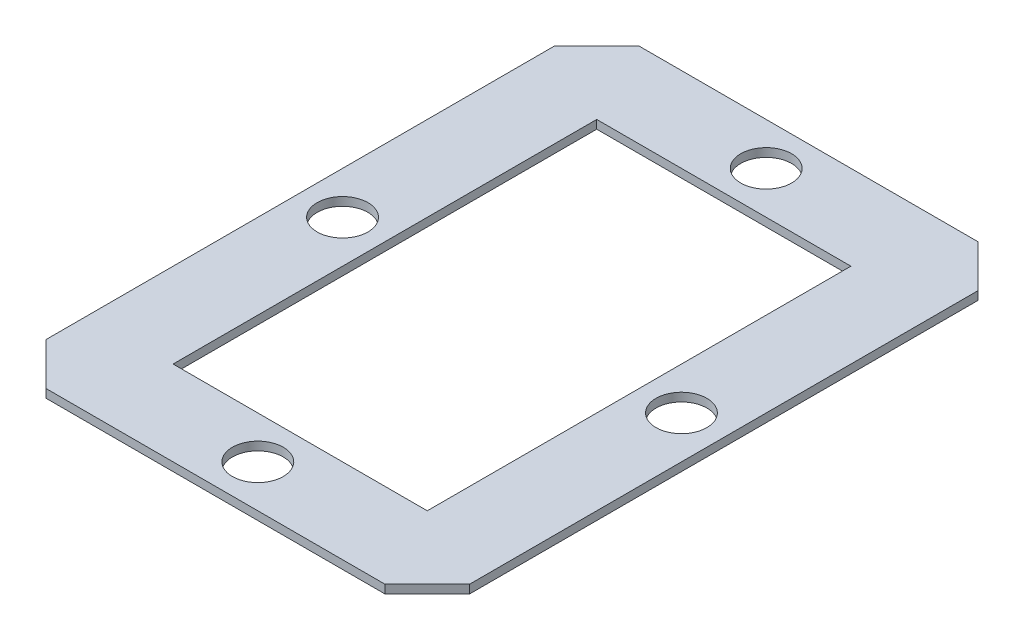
ISO-10303-21;
HEADER;
FILE_DESCRIPTION(('STEP AP214'),'2;1');
FILE_NAME('part.step','',(''),(''),'','','');
FILE_SCHEMA(('AUTOMOTIVE_DESIGN { 1 0 10303 214 1 1 1 1 }'));
ENDSEC;
DATA;
#1=APPLICATION_CONTEXT('core data for automotive mechanical design processes');
#2=APPLICATION_PROTOCOL_DEFINITION('international standard','automotive_design',2000,#1);
#3=PRODUCT_CONTEXT('',#1,'mechanical');
#4=PRODUCT('Part','Part','',(#3));
#5=PRODUCT_RELATED_PRODUCT_CATEGORY('part','',(#4));
#6=PRODUCT_DEFINITION_FORMATION('','',#4);
#7=PRODUCT_DEFINITION_CONTEXT('part definition',#1,'design');
#8=PRODUCT_DEFINITION('design','',#6,#7);
#9=PRODUCT_DEFINITION_SHAPE('','',#8);
#10=(LENGTH_UNIT() NAMED_UNIT(*) SI_UNIT(.MILLI.,.METRE.));
#11=(NAMED_UNIT(*) PLANE_ANGLE_UNIT() SI_UNIT($,.RADIAN.));
#12=(NAMED_UNIT(*) SI_UNIT($,.STERADIAN.) SOLID_ANGLE_UNIT());
#13=UNCERTAINTY_MEASURE_WITH_UNIT(LENGTH_MEASURE(1.E-05),#10,'distance_accuracy_value','');
#14=(GEOMETRIC_REPRESENTATION_CONTEXT(3) GLOBAL_UNCERTAINTY_ASSIGNED_CONTEXT((#13)) GLOBAL_UNIT_ASSIGNED_CONTEXT((#10,
#11,#12)) REPRESENTATION_CONTEXT('',''));
#15=CARTESIAN_POINT('',(0.,0.,0.));
#16=DIRECTION('',(0.,0.,1.));
#17=DIRECTION('',(1.,0.,0.));
#18=AXIS2_PLACEMENT_3D('',#15,#16,#17);
#19=CARTESIAN_POINT('',(-50.,2.,-70.));
#20=DIRECTION('',(0.,0.,1.));
#21=DIRECTION('',(1.,0.,0.));
#22=AXIS2_PLACEMENT_3D('',#19,#20,#21);
#23=PLANE('',#22);
#24=DIRECTION('',(-1.,0.,0.));
#25=VECTOR('',#24,1.);
#26=CARTESIAN_POINT('',(-50.,0.,-70.));
#27=LINE('',#26,#25);
#28=CARTESIAN_POINT('',(40.,0.,-70.));
#29=VERTEX_POINT('',#28);
#30=CARTESIAN_POINT('',(-40.,0.,-70.));
#31=VERTEX_POINT('',#30);
#32=EDGE_CURVE('E177',#29,#31,#27,.T.);
#33=ORIENTED_EDGE('',*,*,#32,.T.);
#34=DIRECTION('',(0.,1.,0.));
#35=VECTOR('',#34,1.);
#36=CARTESIAN_POINT('',(-40.,2.,-70.));
#37=LINE('',#36,#35);
#38=CARTESIAN_POINT('',(-40.,2.,-70.));
#39=VERTEX_POINT('',#38);
#40=EDGE_CURVE('E219',#31,#39,#37,.T.);
#41=ORIENTED_EDGE('',*,*,#40,.T.);
#42=DIRECTION('',(-1.,0.,0.));
#43=VECTOR('',#42,1.);
#44=CARTESIAN_POINT('',(-50.,2.,-70.));
#45=LINE('',#44,#43);
#46=CARTESIAN_POINT('',(40.,2.,-70.));
#47=VERTEX_POINT('',#46);
#48=EDGE_CURVE('E180',#47,#39,#45,.T.);
#49=ORIENTED_EDGE('',*,*,#48,.F.);
#50=DIRECTION('',(0.,-1.,0.));
#51=VECTOR('',#50,1.);
#52=CARTESIAN_POINT('',(40.,2.,-70.));
#53=LINE('',#52,#51);
#54=EDGE_CURVE('E216',#47,#29,#53,.T.);
#55=ORIENTED_EDGE('',*,*,#54,.T.);
#56=EDGE_LOOP('',(#33,#41,#49,#55));
#57=FACE_BOUND('',#56,.T.);
#58=ADVANCED_FACE('F33',(#57),#23,.F.);
#59=CARTESIAN_POINT('',(-50.,2.,70.));
#60=DIRECTION('',(1.,0.,0.));
#61=DIRECTION('',(0.,0.,-1.));
#62=AXIS2_PLACEMENT_3D('',#59,#60,#61);
#63=PLANE('',#62);
#64=DIRECTION('',(0.,0.,1.));
#65=VECTOR('',#64,1.);
#66=CARTESIAN_POINT('',(-50.,2.,70.));
#67=LINE('',#66,#65);
#68=CARTESIAN_POINT('',(-50.,2.,-60.));
#69=VERTEX_POINT('',#68);
#70=CARTESIAN_POINT('',(-50.,2.,60.));
#71=VERTEX_POINT('',#70);
#72=EDGE_CURVE('E183',#69,#71,#67,.T.);
#73=ORIENTED_EDGE('',*,*,#72,.F.);
#74=DIRECTION('',(0.,-1.,0.));
#75=VECTOR('',#74,1.);
#76=CARTESIAN_POINT('',(-50.,2.,-60.));
#77=LINE('',#76,#75);
#78=CARTESIAN_POINT('',(-50.,0.,-60.));
#79=VERTEX_POINT('',#78);
#80=EDGE_CURVE('E205',#69,#79,#77,.T.);
#81=ORIENTED_EDGE('',*,*,#80,.T.);
#82=DIRECTION('',(0.,0.,1.));
#83=VECTOR('',#82,1.);
#84=CARTESIAN_POINT('',(-50.,0.,70.));
#85=LINE('',#84,#83);
#86=CARTESIAN_POINT('',(-50.,0.,60.));
#87=VERTEX_POINT('',#86);
#88=EDGE_CURVE('E196',#79,#87,#85,.T.);
#89=ORIENTED_EDGE('',*,*,#88,.T.);
#90=DIRECTION('',(0.,1.,0.));
#91=VECTOR('',#90,1.);
#92=CARTESIAN_POINT('',(-50.,2.,60.));
#93=LINE('',#92,#91);
#94=EDGE_CURVE('E193',#87,#71,#93,.T.);
#95=ORIENTED_EDGE('',*,*,#94,.T.);
#96=EDGE_LOOP('',(#73,#81,#89,#95));
#97=FACE_BOUND('',#96,.T.);
#98=ADVANCED_FACE('F269',(#97),#63,.F.);
#99=CARTESIAN_POINT('',(-50.,2.,70.));
#100=DIRECTION('',(0.,0.,-1.));
#101=DIRECTION('',(-1.,0.,0.));
#102=AXIS2_PLACEMENT_3D('',#99,#100,#101);
#103=PLANE('',#102);
#104=DIRECTION('',(1.,0.,0.));
#105=VECTOR('',#104,1.);
#106=CARTESIAN_POINT('',(-50.,0.,70.));
#107=LINE('',#106,#105);
#108=CARTESIAN_POINT('',(-40.,0.,70.));
#109=VERTEX_POINT('',#108);
#110=CARTESIAN_POINT('',(40.,0.,70.));
#111=VERTEX_POINT('',#110);
#112=EDGE_CURVE('E199',#109,#111,#107,.T.);
#113=ORIENTED_EDGE('',*,*,#112,.T.);
#114=DIRECTION('',(0.,1.,0.));
#115=VECTOR('',#114,1.);
#116=CARTESIAN_POINT('',(40.,2.,70.));
#117=LINE('',#116,#115);
#118=CARTESIAN_POINT('',(40.,2.,70.));
#119=VERTEX_POINT('',#118);
#120=EDGE_CURVE('E11',#111,#119,#117,.T.);
#121=ORIENTED_EDGE('',*,*,#120,.T.);
#122=DIRECTION('',(1.,0.,0.));
#123=VECTOR('',#122,1.);
#124=CARTESIAN_POINT('',(-50.,2.,70.));
#125=LINE('',#124,#123);
#126=CARTESIAN_POINT('',(-40.,2.,70.));
#127=VERTEX_POINT('',#126);
#128=EDGE_CURVE('E187',#127,#119,#125,.T.);
#129=ORIENTED_EDGE('',*,*,#128,.F.);
#130=DIRECTION('',(0.,-1.,0.));
#131=VECTOR('',#130,1.);
#132=CARTESIAN_POINT('',(-40.,2.,70.));
#133=LINE('',#132,#131);
#134=EDGE_CURVE('E41',#127,#109,#133,.T.);
#135=ORIENTED_EDGE('',*,*,#134,.T.);
#136=EDGE_LOOP('',(#113,#121,#129,#135));
#137=FACE_BOUND('',#136,.T.);
#138=ADVANCED_FACE('F238',(#137),#103,.F.);
#139=CARTESIAN_POINT('',(50.,2.,70.));
#140=DIRECTION('',(-1.,0.,0.));
#141=DIRECTION('',(0.,0.,1.));
#142=AXIS2_PLACEMENT_3D('',#139,#140,#141);
#143=PLANE('',#142);
#144=DIRECTION('',(0.,0.,-1.));
#145=VECTOR('',#144,1.);
#146=CARTESIAN_POINT('',(50.,0.,70.));
#147=LINE('',#146,#145);
#148=CARTESIAN_POINT('',(50.,0.,60.));
#149=VERTEX_POINT('',#148);
#150=CARTESIAN_POINT('',(50.,0.,-60.));
#151=VERTEX_POINT('',#150);
#152=EDGE_CURVE('E184',#149,#151,#147,.T.);
#153=ORIENTED_EDGE('',*,*,#152,.T.);
#154=DIRECTION('',(0.,1.,0.));
#155=VECTOR('',#154,1.);
#156=CARTESIAN_POINT('',(50.,2.,-60.));
#157=LINE('',#156,#155);
#158=CARTESIAN_POINT('',(50.,2.,-60.));
#159=VERTEX_POINT('',#158);
#160=EDGE_CURVE('E232',#151,#159,#157,.T.);
#161=ORIENTED_EDGE('',*,*,#160,.T.);
#162=DIRECTION('',(0.,0.,-1.));
#163=VECTOR('',#162,1.);
#164=CARTESIAN_POINT('',(50.,2.,70.));
#165=LINE('',#164,#163);
#166=CARTESIAN_POINT('',(50.,2.,60.));
#167=VERTEX_POINT('',#166);
#168=EDGE_CURVE('E190',#167,#159,#165,.T.);
#169=ORIENTED_EDGE('',*,*,#168,.F.);
#170=DIRECTION('',(0.,-1.,0.));
#171=VECTOR('',#170,1.);
#172=CARTESIAN_POINT('',(50.,2.,60.));
#173=LINE('',#172,#171);
#174=EDGE_CURVE('E229',#167,#149,#173,.T.);
#175=ORIENTED_EDGE('',*,*,#174,.T.);
#176=EDGE_LOOP('',(#153,#161,#169,#175));
#177=FACE_BOUND('',#176,.T.);
#178=ADVANCED_FACE('F252',(#177),#143,.F.);
#179=CARTESIAN_POINT('',(50.,2.,-70.));
#180=DIRECTION('',(0.,1.,0.));
#181=DIRECTION('',(0.,0.,1.));
#182=AXIS2_PLACEMENT_3D('',#179,#180,#181);
#183=PLANE('',#182);
#184=DIRECTION('',(-1.,0.,0.));
#185=VECTOR('',#184,1.);
#186=CARTESIAN_POINT('',(-30.,2.,50.));
#187=LINE('',#186,#185);
#188=CARTESIAN_POINT('',(30.,2.,50.));
#189=VERTEX_POINT('',#188);
#190=CARTESIAN_POINT('',(-30.,2.,50.));
#191=VERTEX_POINT('',#190);
#192=EDGE_CURVE('E131',#189,#191,#187,.T.);
#193=ORIENTED_EDGE('',*,*,#192,.T.);
#194=DIRECTION('',(0.,0.,-1.));
#195=VECTOR('',#194,1.);
#196=CARTESIAN_POINT('',(-30.,2.,-50.));
#197=LINE('',#196,#195);
#198=CARTESIAN_POINT('',(-30.,2.,-50.));
#199=VERTEX_POINT('',#198);
#200=EDGE_CURVE('E120',#191,#199,#197,.T.);
#201=ORIENTED_EDGE('',*,*,#200,.T.);
#202=DIRECTION('',(1.,0.,0.));
#203=VECTOR('',#202,1.);
#204=CARTESIAN_POINT('',(-30.,2.,-50.));
#205=LINE('',#204,#203);
#206=CARTESIAN_POINT('',(30.,2.,-50.));
#207=VERTEX_POINT('',#206);
#208=EDGE_CURVE('E142',#199,#207,#205,.T.);
#209=ORIENTED_EDGE('',*,*,#208,.T.);
#210=DIRECTION('',(0.,0.,1.));
#211=VECTOR('',#210,1.);
#212=CARTESIAN_POINT('',(30.,2.,-50.));
#213=LINE('',#212,#211);
#214=EDGE_CURVE('E138',#207,#189,#213,.T.);
#215=ORIENTED_EDGE('',*,*,#214,.T.);
#216=EDGE_LOOP('',(#193,#201,#209,#215));
#217=FACE_BOUND('',#216,.T.);
#218=CARTESIAN_POINT('',(-40.,2.,0.));
#219=DIRECTION('',(0.,1.,0.));
#220=DIRECTION('',(0.,0.,1.));
#221=AXIS2_PLACEMENT_3D('',#218,#219,#220);
#222=CIRCLE('',#221,6.00000000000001);
#223=CARTESIAN_POINT('',(-40.,2.,6.00000000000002));
#224=VERTEX_POINT('',#223);
#225=EDGE_CURVE('E127',#224,#224,#222,.T.);
#226=ORIENTED_EDGE('',*,*,#225,.F.);
#227=EDGE_LOOP('',(#226));
#228=FACE_BOUND('',#227,.T.);
#229=CARTESIAN_POINT('',(7.84422772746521E-13,2.,60.));
#230=DIRECTION('',(0.,1.,0.));
#231=DIRECTION('',(0.,0.,1.));
#232=AXIS2_PLACEMENT_3D('',#229,#230,#231);
#233=CIRCLE('',#232,6.);
#234=CARTESIAN_POINT('',(7.84422772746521E-13,2.,66.));
#235=VERTEX_POINT('',#234);
#236=EDGE_CURVE('E159',#235,#235,#233,.T.);
#237=ORIENTED_EDGE('',*,*,#236,.F.);
#238=EDGE_LOOP('',(#237));
#239=FACE_BOUND('',#238,.T.);
#240=CARTESIAN_POINT('',(40.,2.,0.));
#241=DIRECTION('',(0.,1.,0.));
#242=DIRECTION('',(0.,0.,1.));
#243=AXIS2_PLACEMENT_3D('',#240,#241,#242);
#244=CIRCLE('',#243,6.00000000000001);
#245=CARTESIAN_POINT('',(40.,2.,6.00000000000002));
#246=VERTEX_POINT('',#245);
#247=EDGE_CURVE('E165',#246,#246,#244,.T.);
#248=ORIENTED_EDGE('',*,*,#247,.F.);
#249=EDGE_LOOP('',(#248));
#250=FACE_BOUND('',#249,.T.);
#251=CARTESIAN_POINT('',(7.69685902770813E-13,2.,-60.));
#252=DIRECTION('',(0.,1.,0.));
#253=DIRECTION('',(0.,0.,1.));
#254=AXIS2_PLACEMENT_3D('',#251,#252,#253);
#255=CIRCLE('',#254,6.);
#256=CARTESIAN_POINT('',(7.69685902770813E-13,2.,-54.));
#257=VERTEX_POINT('',#256);
#258=EDGE_CURVE('E171',#257,#257,#255,.T.);
#259=ORIENTED_EDGE('',*,*,#258,.F.);
#260=EDGE_LOOP('',(#259));
#261=FACE_BOUND('',#260,.T.);
#262=ORIENTED_EDGE('',*,*,#48,.T.);
#263=DIRECTION('',(0.707106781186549,0.,-0.707106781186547));
#264=VECTOR('',#263,1.);
#265=CARTESIAN_POINT('',(5.00000000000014,2.,-115.));
#266=LINE('',#265,#264);
#267=EDGE_CURVE('E227',#39,#69,#266,.F.);
#268=ORIENTED_EDGE('',*,*,#267,.T.);
#269=ORIENTED_EDGE('',*,*,#72,.T.);
#270=DIRECTION('',(-0.707106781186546,0.,-0.707106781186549));
#271=VECTOR('',#270,1.);
#272=CARTESIAN_POINT('',(-65.0000000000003,2.,44.9999999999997));
#273=LINE('',#272,#271);
#274=EDGE_CURVE('E221',#71,#127,#273,.F.);
#275=ORIENTED_EDGE('',*,*,#274,.T.);
#276=ORIENTED_EDGE('',*,*,#128,.T.);
#277=DIRECTION('',(-0.707106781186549,0.,0.707106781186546));
#278=VECTOR('',#277,1.);
#279=CARTESIAN_POINT('',(115.,2.,-4.99999999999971));
#280=LINE('',#279,#278);
#281=EDGE_CURVE('E223',#119,#167,#280,.F.);
#282=ORIENTED_EDGE('',*,*,#281,.T.);
#283=ORIENTED_EDGE('',*,*,#168,.T.);
#284=DIRECTION('',(0.707106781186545,0.,0.70710678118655));
#285=VECTOR('',#284,1.);
#286=CARTESIAN_POINT('',(45.,2.,-65.));
#287=LINE('',#286,#285);
#288=EDGE_CURVE('E225',#159,#47,#287,.F.);
#289=ORIENTED_EDGE('',*,*,#288,.T.);
#290=EDGE_LOOP('',(#262,#268,#269,#275,#276,#282,#283,#289));
#291=FACE_BOUND('',#290,.T.);
#292=ADVANCED_FACE('F136',(#217,#228,#239,#250,#261,#291),#183,.T.);
#293=CARTESIAN_POINT('',(50.,0.,-70.));
#294=DIRECTION('',(0.,1.,0.));
#295=DIRECTION('',(0.,0.,1.));
#296=AXIS2_PLACEMENT_3D('',#293,#294,#295);
#297=PLANE('',#296);
#298=DIRECTION('',(0.,0.,-1.));
#299=VECTOR('',#298,1.);
#300=CARTESIAN_POINT('',(-30.,0.,-50.));
#301=LINE('',#300,#299);
#302=CARTESIAN_POINT('',(-30.,0.,50.));
#303=VERTEX_POINT('',#302);
#304=CARTESIAN_POINT('',(-30.,0.,-50.));
#305=VERTEX_POINT('',#304);
#306=EDGE_CURVE('E140',#303,#305,#301,.T.);
#307=ORIENTED_EDGE('',*,*,#306,.F.);
#308=DIRECTION('',(-1.,0.,0.));
#309=VECTOR('',#308,1.);
#310=CARTESIAN_POINT('',(-30.,0.,50.));
#311=LINE('',#310,#309);
#312=CARTESIAN_POINT('',(30.,0.,50.));
#313=VERTEX_POINT('',#312);
#314=EDGE_CURVE('E56',#313,#303,#311,.T.);
#315=ORIENTED_EDGE('',*,*,#314,.F.);
#316=DIRECTION('',(0.,0.,1.));
#317=VECTOR('',#316,1.);
#318=CARTESIAN_POINT('',(30.,0.,-50.));
#319=LINE('',#318,#317);
#320=CARTESIAN_POINT('',(30.,0.,-50.));
#321=VERTEX_POINT('',#320);
#322=EDGE_CURVE('E133',#321,#313,#319,.T.);
#323=ORIENTED_EDGE('',*,*,#322,.F.);
#324=DIRECTION('',(1.,0.,0.));
#325=VECTOR('',#324,1.);
#326=CARTESIAN_POINT('',(-30.,0.,-50.));
#327=LINE('',#326,#325);
#328=EDGE_CURVE('E147',#305,#321,#327,.T.);
#329=ORIENTED_EDGE('',*,*,#328,.F.);
#330=EDGE_LOOP('',(#307,#315,#323,#329));
#331=FACE_BOUND('',#330,.T.);
#332=CARTESIAN_POINT('',(-40.,0.,0.));
#333=DIRECTION('',(0.,1.,0.));
#334=DIRECTION('',(0.,0.,1.));
#335=AXIS2_PLACEMENT_3D('',#332,#333,#334);
#336=CIRCLE('',#335,6.00000000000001);
#337=CARTESIAN_POINT('',(-40.,0.,6.00000000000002));
#338=VERTEX_POINT('',#337);
#339=EDGE_CURVE('E156',#338,#338,#336,.T.);
#340=ORIENTED_EDGE('',*,*,#339,.T.);
#341=EDGE_LOOP('',(#340));
#342=FACE_BOUND('',#341,.T.);
#343=CARTESIAN_POINT('',(7.84422772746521E-13,0.,60.));
#344=DIRECTION('',(0.,1.,0.));
#345=DIRECTION('',(0.,0.,1.));
#346=AXIS2_PLACEMENT_3D('',#343,#344,#345);
#347=CIRCLE('',#346,6.);
#348=CARTESIAN_POINT('',(7.84422772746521E-13,0.,66.));
#349=VERTEX_POINT('',#348);
#350=EDGE_CURVE('E162',#349,#349,#347,.T.);
#351=ORIENTED_EDGE('',*,*,#350,.T.);
#352=EDGE_LOOP('',(#351));
#353=FACE_BOUND('',#352,.T.);
#354=CARTESIAN_POINT('',(40.,0.,0.));
#355=DIRECTION('',(0.,1.,0.));
#356=DIRECTION('',(0.,0.,1.));
#357=AXIS2_PLACEMENT_3D('',#354,#355,#356);
#358=CIRCLE('',#357,6.00000000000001);
#359=CARTESIAN_POINT('',(40.,0.,6.00000000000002));
#360=VERTEX_POINT('',#359);
#361=EDGE_CURVE('E168',#360,#360,#358,.T.);
#362=ORIENTED_EDGE('',*,*,#361,.T.);
#363=EDGE_LOOP('',(#362));
#364=FACE_BOUND('',#363,.T.);
#365=CARTESIAN_POINT('',(7.69685902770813E-13,0.,-60.));
#366=DIRECTION('',(0.,1.,0.));
#367=DIRECTION('',(0.,0.,1.));
#368=AXIS2_PLACEMENT_3D('',#365,#366,#367);
#369=CIRCLE('',#368,6.);
#370=CARTESIAN_POINT('',(7.69685902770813E-13,0.,-54.));
#371=VERTEX_POINT('',#370);
#372=EDGE_CURVE('E174',#371,#371,#369,.T.);
#373=ORIENTED_EDGE('',*,*,#372,.T.);
#374=EDGE_LOOP('',(#373));
#375=FACE_BOUND('',#374,.T.);
#376=ORIENTED_EDGE('',*,*,#88,.F.);
#377=DIRECTION('',(-0.707106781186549,0.,0.707106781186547));
#378=VECTOR('',#377,1.);
#379=CARTESIAN_POINT('',(-50.,0.,-60.));
#380=LINE('',#379,#378);
#381=EDGE_CURVE('E214',#79,#31,#380,.F.);
#382=ORIENTED_EDGE('',*,*,#381,.T.);
#383=ORIENTED_EDGE('',*,*,#32,.F.);
#384=DIRECTION('',(-0.707106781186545,0.,-0.70710678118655));
#385=VECTOR('',#384,1.);
#386=CARTESIAN_POINT('',(40.,0.,-70.));
#387=LINE('',#386,#385);
#388=EDGE_CURVE('E212',#29,#151,#387,.F.);
#389=ORIENTED_EDGE('',*,*,#388,.T.);
#390=ORIENTED_EDGE('',*,*,#152,.F.);
#391=DIRECTION('',(0.707106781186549,0.,-0.707106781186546));
#392=VECTOR('',#391,1.);
#393=CARTESIAN_POINT('',(50.,0.,60.));
#394=LINE('',#393,#392);
#395=EDGE_CURVE('E210',#149,#111,#394,.F.);
#396=ORIENTED_EDGE('',*,*,#395,.T.);
#397=ORIENTED_EDGE('',*,*,#112,.F.);
#398=DIRECTION('',(0.707106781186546,0.,0.707106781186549));
#399=VECTOR('',#398,1.);
#400=CARTESIAN_POINT('',(-40.,0.,70.));
#401=LINE('',#400,#399);
#402=EDGE_CURVE('E208',#109,#87,#401,.F.);
#403=ORIENTED_EDGE('',*,*,#402,.T.);
#404=EDGE_LOOP('',(#376,#382,#383,#389,#390,#396,#397,#403));
#405=FACE_BOUND('',#404,.T.);
#406=ADVANCED_FACE('F244',(#331,#342,#353,#364,#375,#405),#297,.F.);
#407=CARTESIAN_POINT('',(7.69685902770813E-13,0.,-60.));
#408=DIRECTION('',(0.,1.,0.));
#409=DIRECTION('',(0.,0.,1.));
#410=AXIS2_PLACEMENT_3D('',#407,#408,#409);
#411=CYLINDRICAL_SURFACE('',#410,6.);
#412=ORIENTED_EDGE('',*,*,#372,.F.);
#413=EDGE_LOOP('',(#412));
#414=FACE_BOUND('',#413,.T.);
#415=ORIENTED_EDGE('',*,*,#258,.T.);
#416=EDGE_LOOP('',(#415));
#417=FACE_BOUND('',#416,.T.);
#418=ADVANCED_FACE('F323',(#414,#417),#411,.F.);
#419=CARTESIAN_POINT('',(40.,0.,0.));
#420=DIRECTION('',(0.,1.,0.));
#421=DIRECTION('',(0.,0.,1.));
#422=AXIS2_PLACEMENT_3D('',#419,#420,#421);
#423=CYLINDRICAL_SURFACE('',#422,6.00000000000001);
#424=ORIENTED_EDGE('',*,*,#361,.F.);
#425=EDGE_LOOP('',(#424));
#426=FACE_BOUND('',#425,.T.);
#427=ORIENTED_EDGE('',*,*,#247,.T.);
#428=EDGE_LOOP('',(#427));
#429=FACE_BOUND('',#428,.T.);
#430=ADVANCED_FACE('F368',(#426,#429),#423,.F.);
#431=CARTESIAN_POINT('',(7.84422772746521E-13,0.,60.));
#432=DIRECTION('',(0.,1.,0.));
#433=DIRECTION('',(0.,0.,1.));
#434=AXIS2_PLACEMENT_3D('',#431,#432,#433);
#435=CYLINDRICAL_SURFACE('',#434,6.);
#436=ORIENTED_EDGE('',*,*,#350,.F.);
#437=EDGE_LOOP('',(#436));
#438=FACE_BOUND('',#437,.T.);
#439=ORIENTED_EDGE('',*,*,#236,.T.);
#440=EDGE_LOOP('',(#439));
#441=FACE_BOUND('',#440,.T.);
#442=ADVANCED_FACE('F364',(#438,#441),#435,.F.);
#443=CARTESIAN_POINT('',(-40.,0.,0.));
#444=DIRECTION('',(0.,1.,0.));
#445=DIRECTION('',(0.,0.,1.));
#446=AXIS2_PLACEMENT_3D('',#443,#444,#445);
#447=CYLINDRICAL_SURFACE('',#446,6.00000000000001);
#448=ORIENTED_EDGE('',*,*,#339,.F.);
#449=EDGE_LOOP('',(#448));
#450=FACE_BOUND('',#449,.T.);
#451=ORIENTED_EDGE('',*,*,#225,.T.);
#452=EDGE_LOOP('',(#451));
#453=FACE_BOUND('',#452,.T.);
#454=ADVANCED_FACE('F288',(#450,#453),#447,.F.);
#455=CARTESIAN_POINT('',(-50.,2.,-60.));
#456=DIRECTION('',(0.707106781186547,0.,0.707106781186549));
#457=DIRECTION('',(0.707106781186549,0.,-0.707106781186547));
#458=AXIS2_PLACEMENT_3D('',#455,#456,#457);
#459=PLANE('',#458);
#460=ORIENTED_EDGE('',*,*,#267,.F.);
#461=ORIENTED_EDGE('',*,*,#40,.F.);
#462=ORIENTED_EDGE('',*,*,#381,.F.);
#463=ORIENTED_EDGE('',*,*,#80,.F.);
#464=EDGE_LOOP('',(#460,#461,#462,#463));
#465=FACE_BOUND('',#464,.T.);
#466=ADVANCED_FACE('F266',(#465),#459,.F.);
#467=CARTESIAN_POINT('',(40.,2.,-70.));
#468=DIRECTION('',(-0.70710678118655,0.,0.707106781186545));
#469=DIRECTION('',(0.707106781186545,0.,0.70710678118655));
#470=AXIS2_PLACEMENT_3D('',#467,#468,#469);
#471=PLANE('',#470);
#472=ORIENTED_EDGE('',*,*,#288,.F.);
#473=ORIENTED_EDGE('',*,*,#160,.F.);
#474=ORIENTED_EDGE('',*,*,#388,.F.);
#475=ORIENTED_EDGE('',*,*,#54,.F.);
#476=EDGE_LOOP('',(#472,#473,#474,#475));
#477=FACE_BOUND('',#476,.T.);
#478=ADVANCED_FACE('F259',(#477),#471,.F.);
#479=CARTESIAN_POINT('',(50.,2.,60.));
#480=DIRECTION('',(-0.707106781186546,0.,-0.707106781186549));
#481=DIRECTION('',(-0.707106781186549,0.,0.707106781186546));
#482=AXIS2_PLACEMENT_3D('',#479,#480,#481);
#483=PLANE('',#482);
#484=ORIENTED_EDGE('',*,*,#281,.F.);
#485=ORIENTED_EDGE('',*,*,#120,.F.);
#486=ORIENTED_EDGE('',*,*,#395,.F.);
#487=ORIENTED_EDGE('',*,*,#174,.F.);
#488=EDGE_LOOP('',(#484,#485,#486,#487));
#489=FACE_BOUND('',#488,.T.);
#490=ADVANCED_FACE('F249',(#489),#483,.F.);
#491=CARTESIAN_POINT('',(-40.,2.,70.));
#492=DIRECTION('',(0.707106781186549,0.,-0.707106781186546));
#493=DIRECTION('',(-0.707106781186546,0.,-0.707106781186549));
#494=AXIS2_PLACEMENT_3D('',#491,#492,#493);
#495=PLANE('',#494);
#496=ORIENTED_EDGE('',*,*,#274,.F.);
#497=ORIENTED_EDGE('',*,*,#94,.F.);
#498=ORIENTED_EDGE('',*,*,#402,.F.);
#499=ORIENTED_EDGE('',*,*,#134,.F.);
#500=EDGE_LOOP('',(#496,#497,#498,#499));
#501=FACE_BOUND('',#500,.T.);
#502=ADVANCED_FACE('F35',(#501),#495,.F.);
#503=CARTESIAN_POINT('',(-30.,2.001,50.));
#504=DIRECTION('',(0.,0.,1.));
#505=DIRECTION('',(1.,0.,0.));
#506=AXIS2_PLACEMENT_3D('',#503,#504,#505);
#507=PLANE('',#506);
#508=DIRECTION('',(0.,-1.,0.));
#509=VECTOR('',#508,1.);
#510=CARTESIAN_POINT('',(30.,2.001,50.));
#511=LINE('',#510,#509);
#512=EDGE_CURVE('E128',#189,#313,#511,.T.);
#513=ORIENTED_EDGE('',*,*,#512,.T.);
#514=ORIENTED_EDGE('',*,*,#314,.T.);
#515=DIRECTION('',(0.,-1.,0.));
#516=VECTOR('',#515,1.);
#517=CARTESIAN_POINT('',(-30.,2.001,50.));
#518=LINE('',#517,#516);
#519=EDGE_CURVE('E122',#191,#303,#518,.T.);
#520=ORIENTED_EDGE('',*,*,#519,.F.);
#521=ORIENTED_EDGE('',*,*,#192,.F.);
#522=EDGE_LOOP('',(#513,#514,#520,#521));
#523=FACE_BOUND('',#522,.T.);
#524=ADVANCED_FACE('F130',(#523),#507,.F.);
#525=CARTESIAN_POINT('',(30.,2.001,-50.));
#526=DIRECTION('',(1.,0.,0.));
#527=DIRECTION('',(0.,0.,-1.));
#528=AXIS2_PLACEMENT_3D('',#525,#526,#527);
#529=PLANE('',#528);
#530=DIRECTION('',(0.,-1.,0.));
#531=VECTOR('',#530,1.);
#532=CARTESIAN_POINT('',(30.,2.001,-50.));
#533=LINE('',#532,#531);
#534=EDGE_CURVE('E153',#207,#321,#533,.T.);
#535=ORIENTED_EDGE('',*,*,#534,.T.);
#536=ORIENTED_EDGE('',*,*,#322,.T.);
#537=ORIENTED_EDGE('',*,*,#512,.F.);
#538=ORIENTED_EDGE('',*,*,#214,.F.);
#539=EDGE_LOOP('',(#535,#536,#537,#538));
#540=FACE_BOUND('',#539,.T.);
#541=ADVANCED_FACE('F276',(#540),#529,.F.);
#542=CARTESIAN_POINT('',(-30.,2.001,-50.));
#543=DIRECTION('',(0.,0.,-1.));
#544=DIRECTION('',(-1.,0.,0.));
#545=AXIS2_PLACEMENT_3D('',#542,#543,#544);
#546=PLANE('',#545);
#547=DIRECTION('',(0.,-1.,0.));
#548=VECTOR('',#547,1.);
#549=CARTESIAN_POINT('',(-30.,2.001,-50.));
#550=LINE('',#549,#548);
#551=EDGE_CURVE('E48',#199,#305,#550,.T.);
#552=ORIENTED_EDGE('',*,*,#551,.T.);
#553=ORIENTED_EDGE('',*,*,#328,.T.);
#554=ORIENTED_EDGE('',*,*,#534,.F.);
#555=ORIENTED_EDGE('',*,*,#208,.F.);
#556=EDGE_LOOP('',(#552,#553,#554,#555));
#557=FACE_BOUND('',#556,.T.);
#558=ADVANCED_FACE('F340',(#557),#546,.F.);
#559=CARTESIAN_POINT('',(-30.,2.001,-50.));
#560=DIRECTION('',(-1.,0.,0.));
#561=DIRECTION('',(0.,0.,1.));
#562=AXIS2_PLACEMENT_3D('',#559,#560,#561);
#563=PLANE('',#562);
#564=ORIENTED_EDGE('',*,*,#519,.T.);
#565=ORIENTED_EDGE('',*,*,#306,.T.);
#566=ORIENTED_EDGE('',*,*,#551,.F.);
#567=ORIENTED_EDGE('',*,*,#200,.F.);
#568=EDGE_LOOP('',(#564,#565,#566,#567));
#569=FACE_BOUND('',#568,.T.);
#570=ADVANCED_FACE('F121',(#569),#563,.F.);
#571=CLOSED_SHELL('',(#58,#98,#138,#178,#292,#406,#418,#430,#442,#454,#466,#478,#490,#502,#524,
#541,#558,#570));
#572=MANIFOLD_SOLID_BREP('B2',#571);
#573=ADVANCED_BREP_SHAPE_REPRESENTATION('',(#18,#572),#14);
#574=SHAPE_DEFINITION_REPRESENTATION(#9,#573);
ENDSEC;
END-ISO-10303-21;
